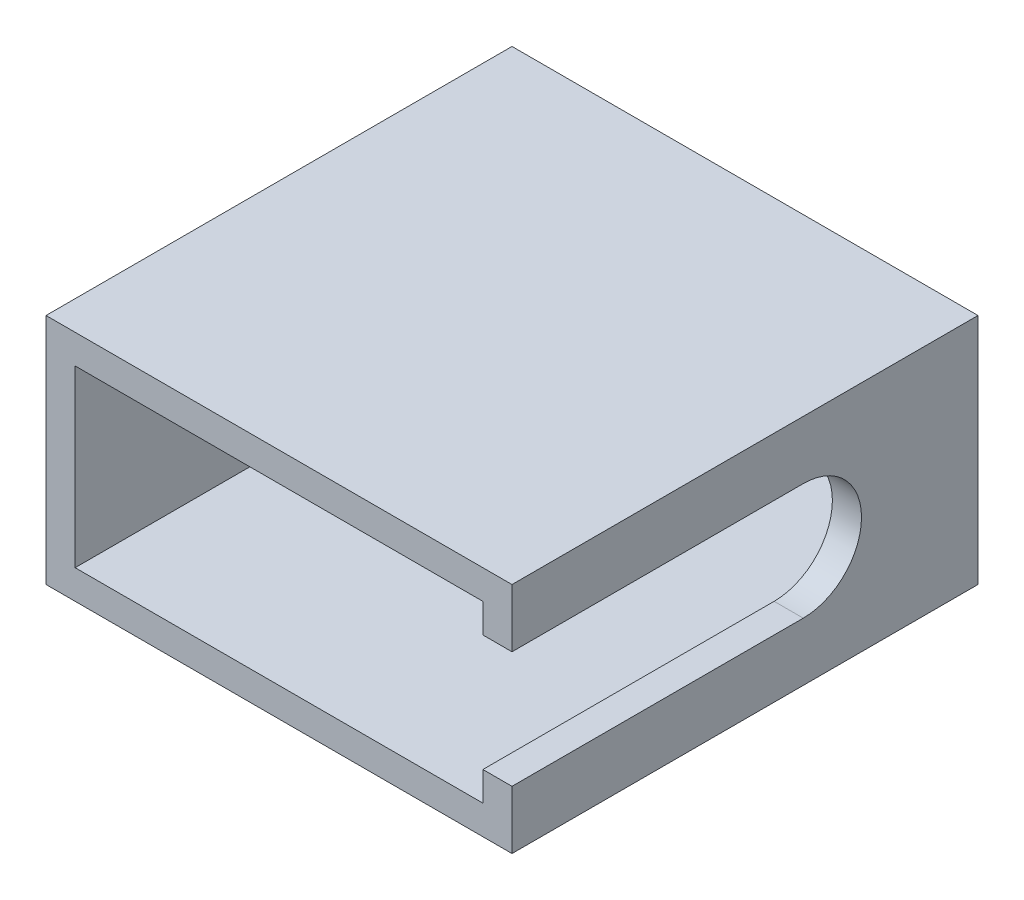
from build123d import *

# Parameters (mm, degrees)
SKETCH1_W           = 50.8
SKETCH1_H           = 25.4
SKETCH1_W_2         = 44.45
SKETCH1_H_2         = 19.05
BOSS_EXTRUDE1_DEPTH = 50.8
CUT_EXTRUDE1_DEPTH  = 71.781852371


with BuildPart() as part:
    # Sketch1 → Boss-Extrude1 (new body)
    with BuildSketch(Plane.XY.offset(50.8)):
        Rectangle(SKETCH1_W, SKETCH1_H)
        Rectangle(SKETCH1_W_2, SKETCH1_H_2, mode=Mode.SUBTRACT)
    extrude(amount=-BOSS_EXTRUDE1_DEPTH)

    # Sketch2 → Cut-Extrude1 (cut, through all)
    with BuildSketch(Plane.ZY.offset(-22.225)):
        with BuildLine():
            Line((50.8, -6.35), (50.8, 6.35))
            Line((50.8, 6.35), (19.05, 6.35))
            ThreePointArc((19.05, 6.35), (12.7, 0), (19.05, -6.35))
            Line((19.05, -6.35), (50.8, -6.35))
        make_face()
    extrude(amount=-CUT_EXTRUDE1_DEPTH, mode=Mode.SUBTRACT)


solid = part.part
